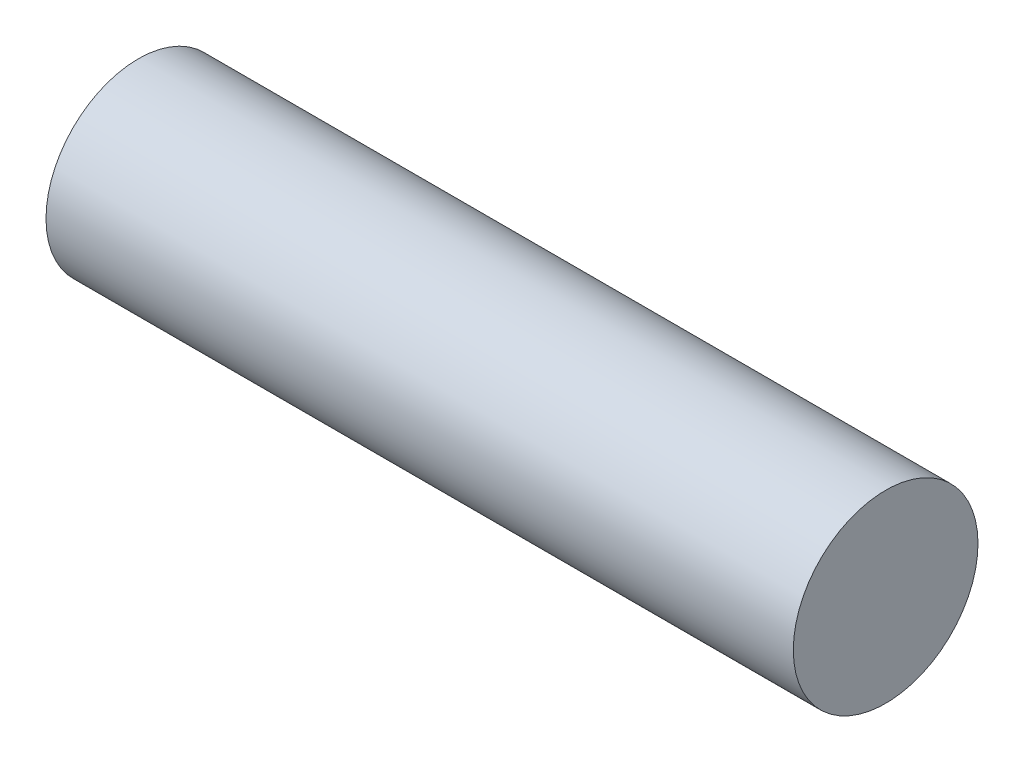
ISO-10303-21;
HEADER;
FILE_DESCRIPTION(('STEP AP214'),'2;1');
FILE_NAME('part.step','',(''),(''),'','','');
FILE_SCHEMA(('AUTOMOTIVE_DESIGN { 1 0 10303 214 1 1 1 1 }'));
ENDSEC;
DATA;
#1=APPLICATION_CONTEXT('core data for automotive mechanical design processes');
#2=APPLICATION_PROTOCOL_DEFINITION('international standard','automotive_design',2000,#1);
#3=PRODUCT_CONTEXT('',#1,'mechanical');
#4=PRODUCT('Part','Part','',(#3));
#5=PRODUCT_RELATED_PRODUCT_CATEGORY('part','',(#4));
#6=PRODUCT_DEFINITION_FORMATION('','',#4);
#7=PRODUCT_DEFINITION_CONTEXT('part definition',#1,'design');
#8=PRODUCT_DEFINITION('design','',#6,#7);
#9=PRODUCT_DEFINITION_SHAPE('','',#8);
#10=(LENGTH_UNIT() NAMED_UNIT(*) SI_UNIT(.MILLI.,.METRE.));
#11=(NAMED_UNIT(*) PLANE_ANGLE_UNIT() SI_UNIT($,.RADIAN.));
#12=(NAMED_UNIT(*) SI_UNIT($,.STERADIAN.) SOLID_ANGLE_UNIT());
#13=UNCERTAINTY_MEASURE_WITH_UNIT(LENGTH_MEASURE(1.E-05),#10,'distance_accuracy_value','');
#14=(GEOMETRIC_REPRESENTATION_CONTEXT(3) GLOBAL_UNCERTAINTY_ASSIGNED_CONTEXT((#13)) GLOBAL_UNIT_ASSIGNED_CONTEXT((#10,
#11,#12)) REPRESENTATION_CONTEXT('',''));
#15=CARTESIAN_POINT('',(0.,0.,0.));
#16=DIRECTION('',(0.,0.,1.));
#17=DIRECTION('',(1.,0.,0.));
#18=AXIS2_PLACEMENT_3D('',#15,#16,#17);
#19=CARTESIAN_POINT('',(41.8993,0.,8.));
#20=DIRECTION('',(-1.,0.,0.));
#21=DIRECTION('',(0.,1.,0.));
#22=AXIS2_PLACEMENT_3D('',#19,#20,#21);
#23=SPHERICAL_SURFACE('',#22,2.4057);
#24=CARTESIAN_POINT('',(43.9547543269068,0.,8.));
#25=DIRECTION('',(-1.,0.,0.));
#26=DIRECTION('',(0.,0.,1.));
#27=AXIS2_PLACEMENT_3D('',#24,#25,#26);
#28=CIRCLE('',#27,1.25);
#29=CARTESIAN_POINT('',(43.9547543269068,0.,9.25));
#30=VERTEX_POINT('',#29);
#31=EDGE_CURVE('E36',#30,#30,#28,.T.);
#32=ORIENTED_EDGE('',*,*,#31,.T.);
#33=EDGE_LOOP('',(#32));
#34=FACE_BOUND('',#33,.T.);
#35=ADVANCED_FACE('F30',(#34),#23,.F.);
#36=CARTESIAN_POINT('',(54.07,0.,8.));
#37=DIRECTION('',(-1.,0.,0.));
#38=DIRECTION('',(0.,0.,1.));
#39=AXIS2_PLACEMENT_3D('',#36,#37,#38);
#40=PLANE('',#39);
#41=CARTESIAN_POINT('',(54.07,0.,8.));
#42=DIRECTION('',(-1.,0.,0.));
#43=DIRECTION('',(0.,0.,1.));
#44=AXIS2_PLACEMENT_3D('',#41,#42,#43);
#45=CIRCLE('',#44,1.25);
#46=CARTESIAN_POINT('',(54.07,0.,9.25));
#47=VERTEX_POINT('',#46);
#48=EDGE_CURVE('E10',#47,#47,#45,.T.);
#49=ORIENTED_EDGE('',*,*,#48,.F.);
#50=EDGE_LOOP('',(#49));
#51=FACE_BOUND('',#50,.T.);
#52=ADVANCED_FACE('F45',(#51),#40,.F.);
#53=CARTESIAN_POINT('',(0.,0.,8.));
#54=DIRECTION('',(-1.,0.,0.));
#55=DIRECTION('',(0.,0.,1.));
#56=AXIS2_PLACEMENT_3D('',#53,#54,#55);
#57=CYLINDRICAL_SURFACE('',#56,1.25);
#58=ORIENTED_EDGE('',*,*,#31,.F.);
#59=EDGE_LOOP('',(#58));
#60=FACE_BOUND('',#59,.T.);
#61=ORIENTED_EDGE('',*,*,#48,.T.);
#62=EDGE_LOOP('',(#61));
#63=FACE_BOUND('',#62,.T.);
#64=ADVANCED_FACE('F43',(#60,#63),#57,.T.);
#65=CLOSED_SHELL('',(#35,#52,#64));
#66=MANIFOLD_SOLID_BREP('B2',#65);
#67=ADVANCED_BREP_SHAPE_REPRESENTATION('',(#18,#66),#14);
#68=SHAPE_DEFINITION_REPRESENTATION(#9,#67);
ENDSEC;
END-ISO-10303-21;
